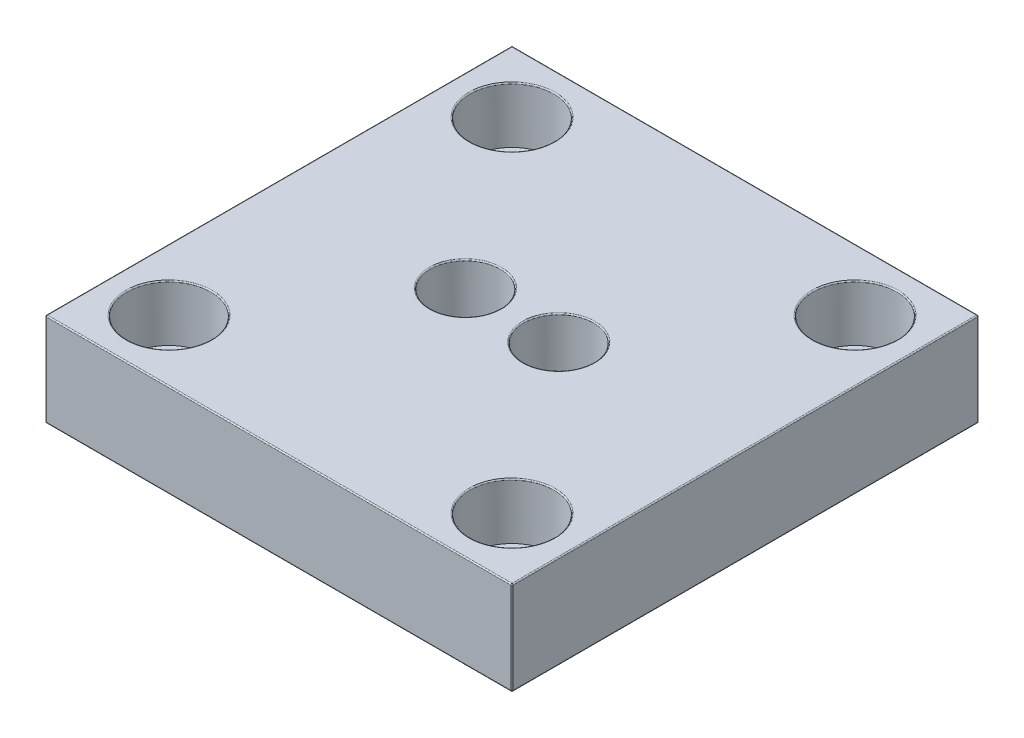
from build123d import *

# Parameters (mm, degrees)
SKETCH1_W           = 100
SKETCH1_H           = 100
BOSS_EXTRUDE1_DEPTH = 20
SKETCH2_R           = 4.5
SKETCH2_R_2         = 5.25
CUT_EXTRUDE1_DEPTH  = 143.828568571
SKETCH3_R           = 7.5
SKETCH3_R_2         = 9
CUT_EXTRUDE2_DEPTH  = 12
FILLET1_R           = 0.25


with BuildPart() as part:
    # Sketch1 → Boss-Extrude1 (new body)
    with BuildSketch(Plane(origin=(0, 0, 0), x_dir=(1, 0, 0), z_dir=(0, 1, 0))):
        with Locations((50, 50)):
            Rectangle(SKETCH1_W, SKETCH1_H)
    extrude(amount=BOSS_EXTRUDE1_DEPTH)

    # Sketch2 → Cut-Extrude1 (cut, through all)
    with BuildSketch(Plane(origin=(0, 20, 0), x_dir=(-1, 0, 0), z_dir=(0, 1, 0))):
        with Locations(Location((-40, -50, 0), (0, 0, 90))):
            Circle(SKETCH2_R)
        with Locations(Location((-13.25, -86.75, 0), (0, 0, 90))):
            Circle(SKETCH2_R_2)
        with Locations(Location((-13.25, -13.25, 0), (0, 0, 90))):
            Circle(SKETCH2_R_2)
        with Locations(Location((-86.75, -13.25, 0), (0, 0, 270))):
            Circle(SKETCH2_R_2)
        with Locations(Location((-60, -50, 0), (0, 0, 270))):
            Circle(SKETCH2_R)
        with Locations(Location((-86.75, -86.75, 0), (0, 0, 270))):
            Circle(SKETCH2_R_2)
    extrude(amount=-CUT_EXTRUDE1_DEPTH, mode=Mode.SUBTRACT)

    # Sketch3 → Cut-Extrude2 (cut)
    with BuildSketch(Plane(origin=(0, 20, 0), x_dir=(1, 0, 0), z_dir=(0, 1, 0))):
        with Locations(Location((40, 50, 0), (0, 0, 270))):
            Circle(SKETCH3_R)
        with Locations(Location((60, 50, 0), (0, 0, 270))):
            Circle(SKETCH3_R)
        with Locations(Location((86.75, 86.75, 0), (0, 0, 270))):
            Circle(SKETCH3_R_2)
        with Locations(Location((13.25, 86.75, 0), (0, 0, 270))):
            Circle(SKETCH3_R_2)
        with Locations(Location((13.25, 13.25, 0), (0, 0, 270))):
            Circle(SKETCH3_R_2)
        with Locations(Location((86.75, 13.25, 0), (0, 0, 270))):
            Circle(SKETCH3_R_2)
    extrude(amount=-CUT_EXTRUDE2_DEPTH, mode=Mode.SUBTRACT)

    # Fillet1
    fillet1_edges = [part.edges().sort_by_distance(p)[0] for p in [
        (100, 20, -50),
        (50, 20, -100),
        (40, 0, -54.5),
        (13.25, 0, -92),
        (13.25, 0, -18.5),
        (86.75, 0, -8),
        (60, 0, -45.5),
        (86.75, 0, -81.5),
        (40, 20, -57.5),
        (0, 20, -50),
        (60, 20, -57.5),
        (50, 0, -100),
        (100, 0, -50),
        (86.75, 20, -95.75),
        (50, 0, 0),
        (13.25, 20, -95.75),
        (0, 0, -50),
        (13.25, 20, -22.25),
        (86.75, 20, -22.25),
        (50, 20, 0),
        (0, 10, -100),
        (100, 10, -100),
        (100, 10, 0),
        (0, 10, 0),
    ]]
    fillet(fillet1_edges, radius=FILLET1_R)


solid = part.part
